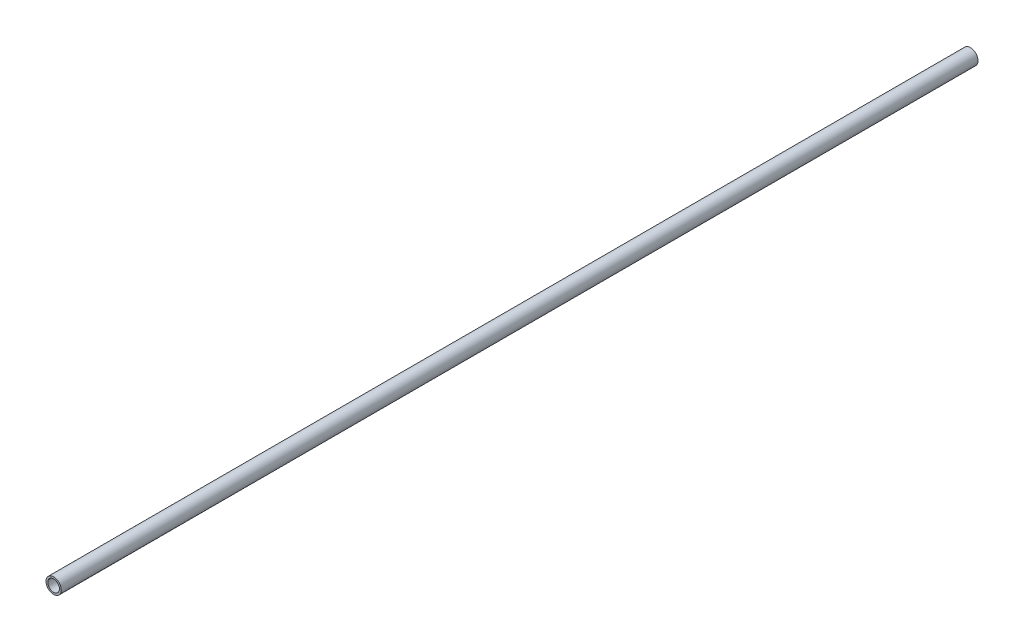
from build123d import *

# Parameters (mm, degrees)
SKETCH1_R           = 12.5
SKETCH1_R_2         = 9.5
BOSS_EXTRUDE1_DEPTH = 1500


with BuildPart() as part:
    # Sketch1 → Boss-Extrude1 (new body)
    with BuildSketch(Plane.XY):
        Circle(SKETCH1_R)
        Circle(SKETCH1_R_2, mode=Mode.SUBTRACT)
    extrude(amount=BOSS_EXTRUDE1_DEPTH)


solid = part.part
